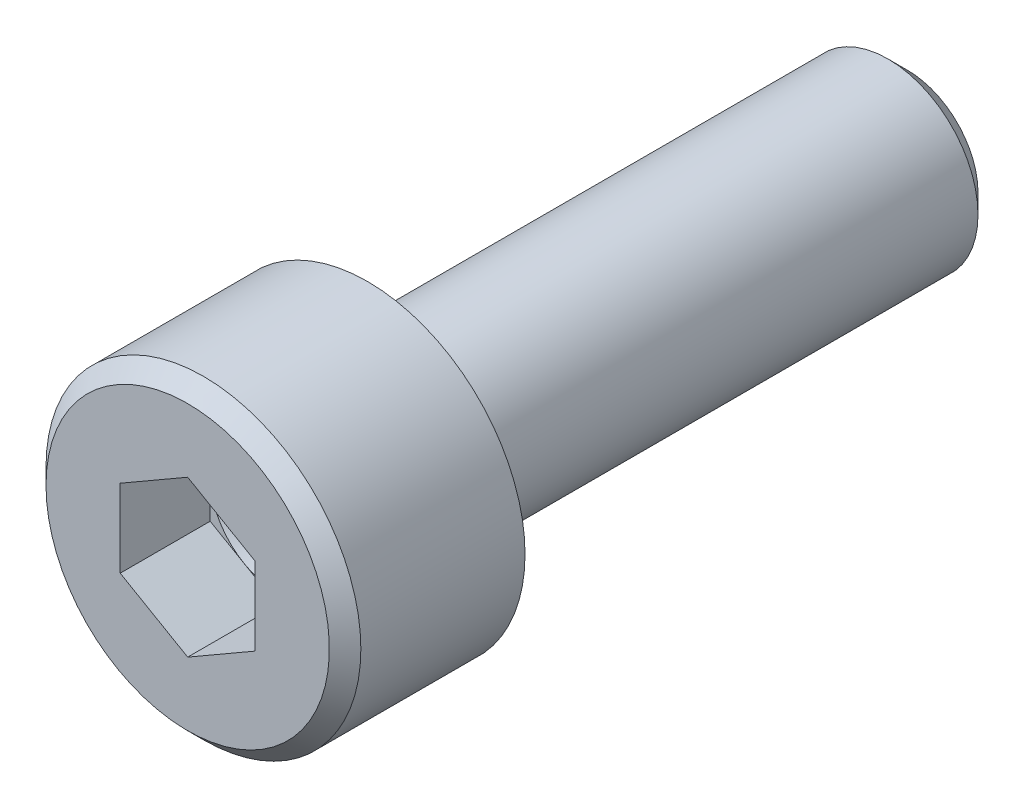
ISO-10303-21;
HEADER;
FILE_DESCRIPTION(('STEP AP214'),'2;1');
FILE_NAME('part.step','',(''),(''),'','','');
FILE_SCHEMA(('AUTOMOTIVE_DESIGN { 1 0 10303 214 1 1 1 1 }'));
ENDSEC;
DATA;
#1=APPLICATION_CONTEXT('core data for automotive mechanical design processes');
#2=APPLICATION_PROTOCOL_DEFINITION('international standard','automotive_design',2000,#1);
#3=PRODUCT_CONTEXT('',#1,'mechanical');
#4=PRODUCT('Part','Part','',(#3));
#5=PRODUCT_RELATED_PRODUCT_CATEGORY('part','',(#4));
#6=PRODUCT_DEFINITION_FORMATION('','',#4);
#7=PRODUCT_DEFINITION_CONTEXT('part definition',#1,'design');
#8=PRODUCT_DEFINITION('design','',#6,#7);
#9=PRODUCT_DEFINITION_SHAPE('','',#8);
#10=(LENGTH_UNIT() NAMED_UNIT(*) SI_UNIT(.MILLI.,.METRE.));
#11=(NAMED_UNIT(*) PLANE_ANGLE_UNIT() SI_UNIT($,.RADIAN.));
#12=(NAMED_UNIT(*) SI_UNIT($,.STERADIAN.) SOLID_ANGLE_UNIT());
#13=UNCERTAINTY_MEASURE_WITH_UNIT(LENGTH_MEASURE(1.E-05),#10,'distance_accuracy_value','');
#14=(GEOMETRIC_REPRESENTATION_CONTEXT(3) GLOBAL_UNCERTAINTY_ASSIGNED_CONTEXT((#13)) GLOBAL_UNIT_ASSIGNED_CONTEXT((#10,
#11,#12)) REPRESENTATION_CONTEXT('',''));
#15=CARTESIAN_POINT('',(0.,0.,0.));
#16=DIRECTION('',(0.,0.,1.));
#17=DIRECTION('',(1.,0.,0.));
#18=AXIS2_PLACEMENT_3D('',#15,#16,#17);
#19=CARTESIAN_POINT('',(0.,0.,2.));
#20=DIRECTION('',(0.,0.,1.));
#21=DIRECTION('',(1.,0.,0.));
#22=AXIS2_PLACEMENT_3D('',#19,#20,#21);
#23=PLANE('',#22);
#24=CARTESIAN_POINT('',(0.,0.,2.00000000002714));
#25=DIRECTION('',(0.,0.,1.));
#26=DIRECTION('',(1.,0.,0.));
#27=AXIS2_PLACEMENT_3D('',#24,#25,#26);
#28=CIRCLE('',#27,1.50000000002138);
#29=CARTESIAN_POINT('',(-1.50000000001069,0.,2.00000000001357));
#30=VERTEX_POINT('',#29);
#31=CARTESIAN_POINT('',(-0.750000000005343,1.29903810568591,2.00000000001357));
#32=VERTEX_POINT('',#31);
#33=EDGE_CURVE('E99',#30,#32,#28,.F.);
#34=ORIENTED_EDGE('',*,*,#33,.T.);
#35=DIRECTION('',(-0.866025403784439,-0.5,0.));
#36=VECTOR('',#35,1.);
#37=CARTESIAN_POINT('',(0.,1.73205080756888,2.));
#38=LINE('',#37,#36);
#39=CARTESIAN_POINT('',(-1.5,0.866025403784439,2.));
#40=VERTEX_POINT('',#39);
#41=EDGE_CURVE('E124',#32,#40,#38,.T.);
#42=ORIENTED_EDGE('',*,*,#41,.T.);
#43=DIRECTION('',(0.,1.,0.));
#44=VECTOR('',#43,1.);
#45=CARTESIAN_POINT('',(-1.5,0.866025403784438,2.));
#46=LINE('',#45,#44);
#47=EDGE_CURVE('E127',#40,#30,#46,.F.);
#48=ORIENTED_EDGE('',*,*,#47,.T.);
#49=EDGE_LOOP('',(#34,#42,#48));
#50=FACE_BOUND('',#49,.T.);
#51=ADVANCED_FACE('F16',(#50),#23,.T.);
#52=CARTESIAN_POINT('',(0.,0.,2.));
#53=DIRECTION('',(0.,0.,1.));
#54=DIRECTION('',(1.,0.,0.));
#55=AXIS2_PLACEMENT_3D('',#52,#53,#54);
#56=PLANE('',#55);
#57=CARTESIAN_POINT('',(0.,0.,2.00000000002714));
#58=DIRECTION('',(0.,0.,1.));
#59=DIRECTION('',(1.,0.,0.));
#60=AXIS2_PLACEMENT_3D('',#57,#58,#59);
#61=CIRCLE('',#60,1.50000000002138);
#62=CARTESIAN_POINT('',(0.750000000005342,1.29903810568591,2.00000000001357));
#63=VERTEX_POINT('',#62);
#64=EDGE_CURVE('E120',#32,#63,#61,.F.);
#65=ORIENTED_EDGE('',*,*,#64,.T.);
#66=DIRECTION('',(-0.866025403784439,0.5,0.));
#67=VECTOR('',#66,1.);
#68=CARTESIAN_POINT('',(1.5,0.866025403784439,2.));
#69=LINE('',#68,#67);
#70=CARTESIAN_POINT('',(0.,1.73205080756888,2.));
#71=VERTEX_POINT('',#70);
#72=EDGE_CURVE('E186',#63,#71,#69,.T.);
#73=ORIENTED_EDGE('',*,*,#72,.T.);
#74=DIRECTION('',(-0.866025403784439,-0.5,0.));
#75=VECTOR('',#74,1.);
#76=CARTESIAN_POINT('',(0.,1.73205080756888,2.));
#77=LINE('',#76,#75);
#78=EDGE_CURVE('E132',#71,#32,#77,.T.);
#79=ORIENTED_EDGE('',*,*,#78,.T.);
#80=EDGE_LOOP('',(#65,#73,#79));
#81=FACE_BOUND('',#80,.T.);
#82=ADVANCED_FACE('F404',(#81),#56,.T.);
#83=CARTESIAN_POINT('',(0.,1.73205080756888,2.));
#84=DIRECTION('',(-0.5,0.866025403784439,0.));
#85=DIRECTION('',(-0.866025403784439,-0.5,0.));
#86=AXIS2_PLACEMENT_3D('',#83,#84,#85);
#87=PLANE('',#86);
#88=DIRECTION('',(0.,0.,1.));
#89=VECTOR('',#88,1.);
#90=CARTESIAN_POINT('',(-1.5,0.866025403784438,2.));
#91=LINE('',#90,#89);
#92=CARTESIAN_POINT('',(-1.5,0.866025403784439,4.));
#93=VERTEX_POINT('',#92);
#94=EDGE_CURVE('E135',#93,#40,#91,.F.);
#95=ORIENTED_EDGE('',*,*,#94,.T.);
#96=ORIENTED_EDGE('',*,*,#41,.F.);
#97=ORIENTED_EDGE('',*,*,#78,.F.);
#98=DIRECTION('',(0.,0.,1.));
#99=VECTOR('',#98,1.);
#100=CARTESIAN_POINT('',(0.,1.73205080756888,2.));
#101=LINE('',#100,#99);
#102=CARTESIAN_POINT('',(0.,1.73205080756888,4.));
#103=VERTEX_POINT('',#102);
#104=EDGE_CURVE('E148',#71,#103,#101,.T.);
#105=ORIENTED_EDGE('',*,*,#104,.T.);
#106=DIRECTION('',(-0.866025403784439,-0.5,0.));
#107=VECTOR('',#106,1.);
#108=CARTESIAN_POINT('',(0.,1.73205080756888,4.));
#109=LINE('',#108,#107);
#110=EDGE_CURVE('E136',#93,#103,#109,.F.);
#111=ORIENTED_EDGE('',*,*,#110,.F.);
#112=EDGE_LOOP('',(#95,#96,#97,#105,#111));
#113=FACE_BOUND('',#112,.T.);
#114=ADVANCED_FACE('F130',(#113),#87,.F.);
#115=CARTESIAN_POINT('',(-1.5,0.866025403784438,2.));
#116=DIRECTION('',(-1.,0.,0.));
#117=DIRECTION('',(0.,0.,1.));
#118=AXIS2_PLACEMENT_3D('',#115,#116,#117);
#119=PLANE('',#118);
#120=DIRECTION('',(0.,0.,1.));
#121=VECTOR('',#120,1.);
#122=CARTESIAN_POINT('',(-1.5,-0.866025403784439,2.));
#123=LINE('',#122,#121);
#124=CARTESIAN_POINT('',(-1.5,-0.866025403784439,4.));
#125=VERTEX_POINT('',#124);
#126=CARTESIAN_POINT('',(-1.5,-0.866025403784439,2.));
#127=VERTEX_POINT('',#126);
#128=EDGE_CURVE('E90',#125,#127,#123,.F.);
#129=ORIENTED_EDGE('',*,*,#128,.T.);
#130=DIRECTION('',(0.,1.,0.));
#131=VECTOR('',#130,1.);
#132=CARTESIAN_POINT('',(-1.5,0.,2.));
#133=LINE('',#132,#131);
#134=EDGE_CURVE('E88',#30,#127,#133,.F.);
#135=ORIENTED_EDGE('',*,*,#134,.F.);
#136=ORIENTED_EDGE('',*,*,#47,.F.);
#137=ORIENTED_EDGE('',*,*,#94,.F.);
#138=DIRECTION('',(0.,1.,0.));
#139=VECTOR('',#138,1.);
#140=CARTESIAN_POINT('',(-1.5,0.866025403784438,4.));
#141=LINE('',#140,#139);
#142=EDGE_CURVE('E200',#125,#93,#141,.T.);
#143=ORIENTED_EDGE('',*,*,#142,.F.);
#144=EDGE_LOOP('',(#129,#135,#136,#137,#143));
#145=FACE_BOUND('',#144,.T.);
#146=ADVANCED_FACE('F246',(#145),#119,.F.);
#147=CARTESIAN_POINT('',(0.,0.,2.));
#148=DIRECTION('',(0.,0.,1.));
#149=DIRECTION('',(1.,0.,0.));
#150=AXIS2_PLACEMENT_3D('',#147,#148,#149);
#151=PLANE('',#150);
#152=CARTESIAN_POINT('',(0.,0.,2.00000000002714));
#153=DIRECTION('',(0.,0.,1.));
#154=DIRECTION('',(1.,0.,0.));
#155=AXIS2_PLACEMENT_3D('',#152,#153,#154);
#156=CIRCLE('',#155,1.50000000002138);
#157=CARTESIAN_POINT('',(-0.750000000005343,-1.29903810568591,2.00000000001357));
#158=VERTEX_POINT('',#157);
#159=EDGE_CURVE('E19',#158,#30,#156,.F.);
#160=ORIENTED_EDGE('',*,*,#159,.T.);
#161=ORIENTED_EDGE('',*,*,#134,.T.);
#162=DIRECTION('',(0.866025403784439,-0.5,0.));
#163=VECTOR('',#162,1.);
#164=CARTESIAN_POINT('',(-1.5,-0.866025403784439,2.));
#165=LINE('',#164,#163);
#166=EDGE_CURVE('E83',#127,#158,#165,.T.);
#167=ORIENTED_EDGE('',*,*,#166,.T.);
#168=EDGE_LOOP('',(#160,#161,#167));
#169=FACE_BOUND('',#168,.T.);
#170=ADVANCED_FACE('F85',(#169),#151,.T.);
#171=CARTESIAN_POINT('',(0.,0.,1.99999999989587));
#172=DIRECTION('',(0.,0.,1.));
#173=DIRECTION('',(1.,0.,0.));
#174=AXIS2_PLACEMENT_3D('',#171,#172,#173);
#175=CONICAL_SURFACE('',#174,1.499999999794,1.04719755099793);
#176=CARTESIAN_POINT('',(-1.13686837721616E-10,0.,1.13397459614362));
#177=VERTEX_POINT('',#176);
#178=VERTEX_LOOP('',#177);
#179=FACE_BOUND('',#178,.T.);
#180=ORIENTED_EDGE('',*,*,#64,.F.);
#181=ORIENTED_EDGE('',*,*,#33,.F.);
#182=ORIENTED_EDGE('',*,*,#159,.F.);
#183=CARTESIAN_POINT('',(0.,0.,2.00000000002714));
#184=DIRECTION('',(0.,0.,1.));
#185=DIRECTION('',(1.,0.,0.));
#186=AXIS2_PLACEMENT_3D('',#183,#184,#185);
#187=CIRCLE('',#186,1.50000000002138);
#188=CARTESIAN_POINT('',(0.750000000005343,-1.29903810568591,2.00000000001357));
#189=VERTEX_POINT('',#188);
#190=EDGE_CURVE('E96',#189,#158,#187,.F.);
#191=ORIENTED_EDGE('',*,*,#190,.F.);
#192=CARTESIAN_POINT('',(0.,0.,2.00000000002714));
#193=DIRECTION('',(0.,0.,1.));
#194=DIRECTION('',(1.,0.,0.));
#195=AXIS2_PLACEMENT_3D('',#192,#193,#194);
#196=CIRCLE('',#195,1.50000000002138);
#197=CARTESIAN_POINT('',(1.50000000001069,0.,2.00000000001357));
#198=VERTEX_POINT('',#197);
#199=EDGE_CURVE('E106',#198,#189,#196,.F.);
#200=ORIENTED_EDGE('',*,*,#199,.F.);
#201=CARTESIAN_POINT('',(0.,0.,2.00000000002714));
#202=DIRECTION('',(0.,0.,1.));
#203=DIRECTION('',(1.,0.,0.));
#204=AXIS2_PLACEMENT_3D('',#201,#202,#203);
#205=CIRCLE('',#204,1.50000000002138);
#206=EDGE_CURVE('E116',#63,#198,#205,.F.);
#207=ORIENTED_EDGE('',*,*,#206,.F.);
#208=EDGE_LOOP('',(#180,#181,#182,#191,#200,#207));
#209=FACE_BOUND('',#208,.T.);
#210=ADVANCED_FACE('F94',(#179,#209),#175,.F.);
#211=CARTESIAN_POINT('',(0.,0.,2.));
#212=DIRECTION('',(0.,0.,1.));
#213=DIRECTION('',(1.,0.,0.));
#214=AXIS2_PLACEMENT_3D('',#211,#212,#213);
#215=PLANE('',#214);
#216=ORIENTED_EDGE('',*,*,#206,.T.);
#217=DIRECTION('',(0.,1.,0.));
#218=VECTOR('',#217,1.);
#219=CARTESIAN_POINT('',(1.5,-0.866025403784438,2.));
#220=LINE('',#219,#218);
#221=CARTESIAN_POINT('',(1.5,0.866025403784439,2.));
#222=VERTEX_POINT('',#221);
#223=EDGE_CURVE('E178',#198,#222,#220,.T.);
#224=ORIENTED_EDGE('',*,*,#223,.T.);
#225=DIRECTION('',(-0.866025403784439,0.5,0.));
#226=VECTOR('',#225,1.);
#227=CARTESIAN_POINT('',(1.5,0.866025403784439,2.));
#228=LINE('',#227,#226);
#229=EDGE_CURVE('E119',#222,#63,#228,.T.);
#230=ORIENTED_EDGE('',*,*,#229,.T.);
#231=EDGE_LOOP('',(#216,#224,#230));
#232=FACE_BOUND('',#231,.T.);
#233=ADVANCED_FACE('F236',(#232),#215,.T.);
#234=CARTESIAN_POINT('',(1.5,0.866025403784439,2.));
#235=DIRECTION('',(0.5,0.866025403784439,0.));
#236=DIRECTION('',(-0.866025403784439,0.5,0.));
#237=AXIS2_PLACEMENT_3D('',#234,#235,#236);
#238=PLANE('',#237);
#239=ORIENTED_EDGE('',*,*,#104,.F.);
#240=ORIENTED_EDGE('',*,*,#72,.F.);
#241=ORIENTED_EDGE('',*,*,#229,.F.);
#242=DIRECTION('',(0.,0.,-1.));
#243=VECTOR('',#242,1.);
#244=CARTESIAN_POINT('',(1.5,0.866025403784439,2.));
#245=LINE('',#244,#243);
#246=CARTESIAN_POINT('',(1.5,0.866025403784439,4.));
#247=VERTEX_POINT('',#246);
#248=EDGE_CURVE('E180',#222,#247,#245,.F.);
#249=ORIENTED_EDGE('',*,*,#248,.T.);
#250=DIRECTION('',(-0.866025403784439,0.5,0.));
#251=VECTOR('',#250,1.);
#252=CARTESIAN_POINT('',(1.5,0.866025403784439,4.));
#253=LINE('',#252,#251);
#254=EDGE_CURVE('E145',#103,#247,#253,.F.);
#255=ORIENTED_EDGE('',*,*,#254,.F.);
#256=EDGE_LOOP('',(#239,#240,#241,#249,#255));
#257=FACE_BOUND('',#256,.T.);
#258=ADVANCED_FACE('F223',(#257),#238,.F.);
#259=CARTESIAN_POINT('',(-1.5,-0.866025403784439,2.));
#260=DIRECTION('',(-0.5,-0.866025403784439,0.));
#261=DIRECTION('',(0.866025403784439,-0.5,0.));
#262=AXIS2_PLACEMENT_3D('',#259,#260,#261);
#263=PLANE('',#262);
#264=DIRECTION('',(0.,0.,1.));
#265=VECTOR('',#264,1.);
#266=CARTESIAN_POINT('',(0.,-1.73205080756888,2.));
#267=LINE('',#266,#265);
#268=CARTESIAN_POINT('',(0.,-1.73205080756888,4.));
#269=VERTEX_POINT('',#268);
#270=CARTESIAN_POINT('',(0.,-1.73205080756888,2.));
#271=VERTEX_POINT('',#270);
#272=EDGE_CURVE('E103',#269,#271,#267,.F.);
#273=ORIENTED_EDGE('',*,*,#272,.T.);
#274=DIRECTION('',(0.866025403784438,-0.5,0.));
#275=VECTOR('',#274,1.);
#276=CARTESIAN_POINT('',(-0.75,-1.29903810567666,2.));
#277=LINE('',#276,#275);
#278=EDGE_CURVE('E101',#158,#271,#277,.T.);
#279=ORIENTED_EDGE('',*,*,#278,.F.);
#280=ORIENTED_EDGE('',*,*,#166,.F.);
#281=ORIENTED_EDGE('',*,*,#128,.F.);
#282=DIRECTION('',(0.866025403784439,-0.5,0.));
#283=VECTOR('',#282,1.);
#284=CARTESIAN_POINT('',(-1.5,-0.866025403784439,4.));
#285=LINE('',#284,#283);
#286=EDGE_CURVE('E34',#269,#125,#285,.F.);
#287=ORIENTED_EDGE('',*,*,#286,.F.);
#288=EDGE_LOOP('',(#273,#279,#280,#281,#287));
#289=FACE_BOUND('',#288,.T.);
#290=ADVANCED_FACE('F102',(#289),#263,.F.);
#291=CARTESIAN_POINT('',(0.,0.,2.));
#292=DIRECTION('',(0.,0.,1.));
#293=DIRECTION('',(1.,0.,0.));
#294=AXIS2_PLACEMENT_3D('',#291,#292,#293);
#295=PLANE('',#294);
#296=ORIENTED_EDGE('',*,*,#190,.T.);
#297=ORIENTED_EDGE('',*,*,#278,.T.);
#298=DIRECTION('',(0.866025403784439,0.5,0.));
#299=VECTOR('',#298,1.);
#300=CARTESIAN_POINT('',(0.,-1.73205080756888,2.));
#301=LINE('',#300,#299);
#302=EDGE_CURVE('E109',#271,#189,#301,.T.);
#303=ORIENTED_EDGE('',*,*,#302,.T.);
#304=EDGE_LOOP('',(#296,#297,#303));
#305=FACE_BOUND('',#304,.T.);
#306=ADVANCED_FACE('F108',(#305),#295,.T.);
#307=CARTESIAN_POINT('',(0.,0.,2.));
#308=DIRECTION('',(0.,0.,1.));
#309=DIRECTION('',(1.,0.,0.));
#310=AXIS2_PLACEMENT_3D('',#307,#308,#309);
#311=PLANE('',#310);
#312=ORIENTED_EDGE('',*,*,#199,.T.);
#313=DIRECTION('',(0.866025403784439,0.5,0.));
#314=VECTOR('',#313,1.);
#315=CARTESIAN_POINT('',(0.,-1.73205080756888,2.));
#316=LINE('',#315,#314);
#317=CARTESIAN_POINT('',(1.5,-0.86602540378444,2.));
#318=VERTEX_POINT('',#317);
#319=EDGE_CURVE('E171',#189,#318,#316,.T.);
#320=ORIENTED_EDGE('',*,*,#319,.T.);
#321=DIRECTION('',(0.,1.,0.));
#322=VECTOR('',#321,1.);
#323=CARTESIAN_POINT('',(1.5,-0.866025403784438,2.));
#324=LINE('',#323,#322);
#325=EDGE_CURVE('E181',#318,#198,#324,.T.);
#326=ORIENTED_EDGE('',*,*,#325,.T.);
#327=EDGE_LOOP('',(#312,#320,#326));
#328=FACE_BOUND('',#327,.T.);
#329=ADVANCED_FACE('F284',(#328),#311,.T.);
#330=CARTESIAN_POINT('',(1.5,-0.866025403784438,2.));
#331=DIRECTION('',(1.,0.,0.));
#332=DIRECTION('',(0.,0.,-1.));
#333=AXIS2_PLACEMENT_3D('',#330,#331,#332);
#334=PLANE('',#333);
#335=ORIENTED_EDGE('',*,*,#248,.F.);
#336=ORIENTED_EDGE('',*,*,#223,.F.);
#337=ORIENTED_EDGE('',*,*,#325,.F.);
#338=DIRECTION('',(0.,0.,1.));
#339=VECTOR('',#338,1.);
#340=CARTESIAN_POINT('',(1.5,-0.866025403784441,2.));
#341=LINE('',#340,#339);
#342=CARTESIAN_POINT('',(1.5,-0.866025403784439,4.));
#343=VERTEX_POINT('',#342);
#344=EDGE_CURVE('E165',#318,#343,#341,.T.);
#345=ORIENTED_EDGE('',*,*,#344,.T.);
#346=DIRECTION('',(0.,1.,0.));
#347=VECTOR('',#346,1.);
#348=CARTESIAN_POINT('',(1.5,-0.866025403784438,4.));
#349=LINE('',#348,#347);
#350=EDGE_CURVE('E191',#247,#343,#349,.F.);
#351=ORIENTED_EDGE('',*,*,#350,.F.);
#352=EDGE_LOOP('',(#335,#336,#337,#345,#351));
#353=FACE_BOUND('',#352,.T.);
#354=ADVANCED_FACE('F281',(#353),#334,.F.);
#355=CARTESIAN_POINT('',(0.,-1.73205080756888,2.));
#356=DIRECTION('',(0.5,-0.866025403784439,0.));
#357=DIRECTION('',(0.866025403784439,0.5,0.));
#358=AXIS2_PLACEMENT_3D('',#355,#356,#357);
#359=PLANE('',#358);
#360=ORIENTED_EDGE('',*,*,#344,.F.);
#361=ORIENTED_EDGE('',*,*,#319,.F.);
#362=ORIENTED_EDGE('',*,*,#302,.F.);
#363=ORIENTED_EDGE('',*,*,#272,.F.);
#364=DIRECTION('',(0.866025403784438,0.5,0.));
#365=VECTOR('',#364,1.);
#366=CARTESIAN_POINT('',(0.,-1.73205080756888,4.));
#367=LINE('',#366,#365);
#368=EDGE_CURVE('E159',#269,#343,#367,.T.);
#369=ORIENTED_EDGE('',*,*,#368,.T.);
#370=EDGE_LOOP('',(#360,#361,#362,#363,#369));
#371=FACE_BOUND('',#370,.T.);
#372=ADVANCED_FACE('F278',(#371),#359,.F.);
#373=CARTESIAN_POINT('',(0.,0.,4.));
#374=DIRECTION('',(0.,0.,-1.));
#375=DIRECTION('',(-1.,0.,0.));
#376=AXIS2_PLACEMENT_3D('',#373,#374,#375);
#377=PLANE('',#376);
#378=ORIENTED_EDGE('',*,*,#286,.T.);
#379=ORIENTED_EDGE('',*,*,#142,.T.);
#380=ORIENTED_EDGE('',*,*,#110,.T.);
#381=ORIENTED_EDGE('',*,*,#254,.T.);
#382=ORIENTED_EDGE('',*,*,#350,.T.);
#383=ORIENTED_EDGE('',*,*,#368,.F.);
#384=EDGE_LOOP('',(#378,#379,#380,#381,#382,#383));
#385=FACE_BOUND('',#384,.T.);
#386=CARTESIAN_POINT('',(0.,0.,3.99999999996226));
#387=DIRECTION('',(0.,0.,-1.));
#388=DIRECTION('',(-1.,0.,0.));
#389=AXIS2_PLACEMENT_3D('',#386,#387,#388);
#390=CIRCLE('',#389,3.15000000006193);
#391=CARTESIAN_POINT('',(-3.15000000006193,0.,3.99999999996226));
#392=VERTEX_POINT('',#391);
#393=EDGE_CURVE('E157',#392,#392,#390,.T.);
#394=ORIENTED_EDGE('',*,*,#393,.F.);
#395=EDGE_LOOP('',(#394));
#396=FACE_BOUND('',#395,.T.);
#397=ADVANCED_FACE('F228',(#385,#396),#377,.F.);
#398=CARTESIAN_POINT('',(0.,0.,3.65000000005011));
#399=DIRECTION('',(0.,0.,-1.));
#400=DIRECTION('',(-1.,0.,0.));
#401=AXIS2_PLACEMENT_3D('',#398,#399,#400);
#402=CONICAL_SURFACE('',#401,3.49999999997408,0.785398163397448);
#403=ORIENTED_EDGE('',*,*,#393,.T.);
#404=EDGE_LOOP('',(#403));
#405=FACE_BOUND('',#404,.T.);
#406=CARTESIAN_POINT('',(0.,0.,3.65));
#407=DIRECTION('',(0.,0.,1.));
#408=DIRECTION('',(1.,0.,0.));
#409=AXIS2_PLACEMENT_3D('',#406,#407,#408);
#410=CIRCLE('',#409,3.5);
#411=CARTESIAN_POINT('',(3.5,0.,3.65));
#412=VERTEX_POINT('',#411);
#413=EDGE_CURVE('E156',#412,#412,#410,.F.);
#414=ORIENTED_EDGE('',*,*,#413,.F.);
#415=EDGE_LOOP('',(#414));
#416=FACE_BOUND('',#415,.T.);
#417=ADVANCED_FACE('F272',(#405,#416),#402,.T.);
#418=CARTESIAN_POINT('',(0.,1.5705,-12.));
#419=DIRECTION('',(0.,0.,1.));
#420=DIRECTION('',(1.,0.,0.));
#421=AXIS2_PLACEMENT_3D('',#418,#419,#420);
#422=PLANE('',#421);
#423=CARTESIAN_POINT('',(0.,0.,-12.0000000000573));
#424=DIRECTION('',(0.,0.,1.));
#425=DIRECTION('',(1.,0.,0.));
#426=AXIS2_PLACEMENT_3D('',#423,#424,#425);
#427=CIRCLE('',#426,1.57050000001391);
#428=CARTESIAN_POINT('',(1.57050000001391,0.,-12.0000000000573));
#429=VERTEX_POINT('',#428);
#430=EDGE_CURVE('E154',#429,#429,#427,.T.);
#431=ORIENTED_EDGE('',*,*,#430,.F.);
#432=EDGE_LOOP('',(#431));
#433=FACE_BOUND('',#432,.T.);
#434=ADVANCED_FACE('F268',(#433),#422,.F.);
#435=CARTESIAN_POINT('',(0.,0.,0.));
#436=DIRECTION('',(0.,0.,1.));
#437=DIRECTION('',(1.,0.,0.));
#438=AXIS2_PLACEMENT_3D('',#435,#436,#437);
#439=CYLINDRICAL_SURFACE('',#438,3.5);
#440=ORIENTED_EDGE('',*,*,#413,.T.);
#441=EDGE_LOOP('',(#440));
#442=FACE_BOUND('',#441,.T.);
#443=CARTESIAN_POINT('',(0.,0.,0.));
#444=DIRECTION('',(0.,0.,1.));
#445=DIRECTION('',(1.,0.,0.));
#446=AXIS2_PLACEMENT_3D('',#443,#444,#445);
#447=CIRCLE('',#446,3.5);
#448=CARTESIAN_POINT('',(3.5,0.,0.));
#449=VERTEX_POINT('',#448);
#450=EDGE_CURVE('E151',#449,#449,#447,.T.);
#451=ORIENTED_EDGE('',*,*,#450,.T.);
#452=EDGE_LOOP('',(#451));
#453=FACE_BOUND('',#452,.T.);
#454=ADVANCED_FACE('F264',(#442,#453),#439,.T.);
#455=CARTESIAN_POINT('',(0.,0.,-11.5705000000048));
#456=DIRECTION('',(0.,0.,1.));
#457=DIRECTION('',(1.,0.,0.));
#458=AXIS2_PLACEMENT_3D('',#455,#456,#457);
#459=CONICAL_SURFACE('',#458,2.00000000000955,0.785398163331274);
#460=CARTESIAN_POINT('',(0.,0.,-11.5705));
#461=DIRECTION('',(0.,0.,1.));
#462=DIRECTION('',(1.,0.,0.));
#463=AXIS2_PLACEMENT_3D('',#460,#461,#462);
#464=CIRCLE('',#463,2.);
#465=CARTESIAN_POINT('',(2.,0.,-11.5705));
#466=VERTEX_POINT('',#465);
#467=EDGE_CURVE('E25',#466,#466,#464,.T.);
#468=ORIENTED_EDGE('',*,*,#467,.F.);
#469=EDGE_LOOP('',(#468));
#470=FACE_BOUND('',#469,.T.);
#471=ORIENTED_EDGE('',*,*,#430,.T.);
#472=EDGE_LOOP('',(#471));
#473=FACE_BOUND('',#472,.T.);
#474=ADVANCED_FACE('F257',(#470,#473),#459,.T.);
#475=CARTESIAN_POINT('',(0.,3.5,0.));
#476=DIRECTION('',(0.,0.,1.));
#477=DIRECTION('',(1.,0.,0.));
#478=AXIS2_PLACEMENT_3D('',#475,#476,#477);
#479=PLANE('',#478);
#480=ORIENTED_EDGE('',*,*,#450,.F.);
#481=EDGE_LOOP('',(#480));
#482=FACE_BOUND('',#481,.T.);
#483=CARTESIAN_POINT('',(0.,0.,0.));
#484=DIRECTION('',(0.,0.,1.));
#485=DIRECTION('',(1.,0.,0.));
#486=AXIS2_PLACEMENT_3D('',#483,#484,#485);
#487=CIRCLE('',#486,2.);
#488=CARTESIAN_POINT('',(2.,0.,0.));
#489=VERTEX_POINT('',#488);
#490=EDGE_CURVE('E11',#489,#489,#487,.F.);
#491=ORIENTED_EDGE('',*,*,#490,.F.);
#492=EDGE_LOOP('',(#491));
#493=FACE_BOUND('',#492,.T.);
#494=ADVANCED_FACE('F250',(#482,#493),#479,.F.);
#495=CARTESIAN_POINT('',(0.,0.,-12.));
#496=DIRECTION('',(0.,0.,1.));
#497=DIRECTION('',(1.,0.,0.));
#498=AXIS2_PLACEMENT_3D('',#495,#496,#497);
#499=CYLINDRICAL_SURFACE('',#498,2.);
#500=ORIENTED_EDGE('',*,*,#490,.T.);
#501=EDGE_LOOP('',(#500));
#502=FACE_BOUND('',#501,.T.);
#503=ORIENTED_EDGE('',*,*,#467,.T.);
#504=EDGE_LOOP('',(#503));
#505=FACE_BOUND('',#504,.T.);
#506=ADVANCED_FACE('F248',(#502,#505),#499,.T.);
#507=CLOSED_SHELL('',(#51,#82,#114,#146,#170,#210,#233,#258,#290,#306,#329,#354,#372,#397,#417,
#434,#454,#474,#494,#506));
#508=MANIFOLD_SOLID_BREP('B1',#507);
#509=ADVANCED_BREP_SHAPE_REPRESENTATION('',(#18,#508),#14);
#510=SHAPE_DEFINITION_REPRESENTATION(#9,#509);
ENDSEC;
END-ISO-10303-21;
